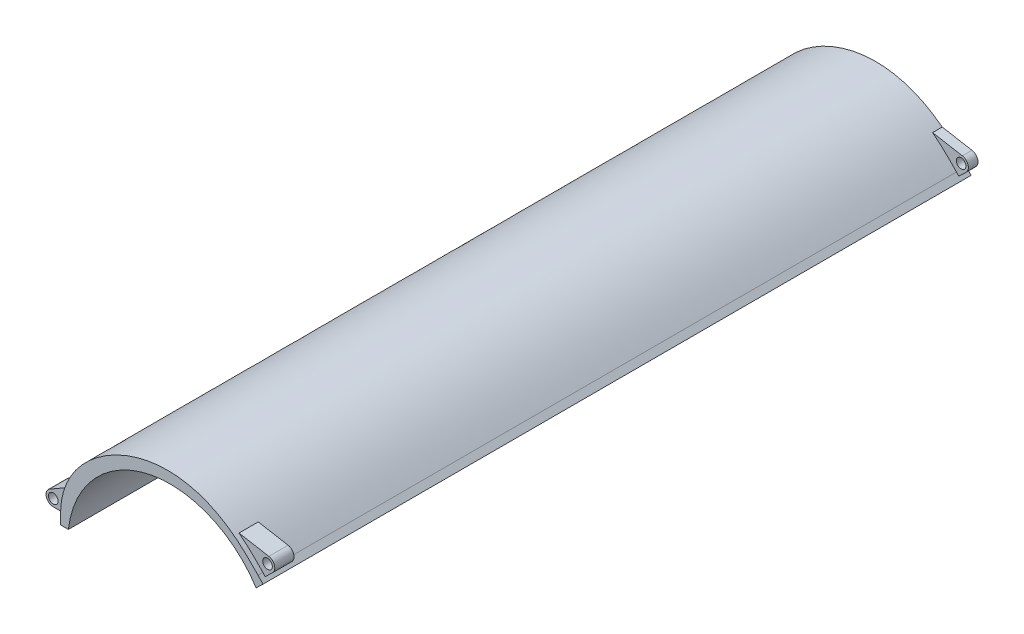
ISO-10303-21;
HEADER;
FILE_DESCRIPTION(('STEP AP214'),'2;1');
FILE_NAME('part.step','',(''),(''),'','','');
FILE_SCHEMA(('AUTOMOTIVE_DESIGN { 1 0 10303 214 1 1 1 1 }'));
ENDSEC;
DATA;
#1=APPLICATION_CONTEXT('core data for automotive mechanical design processes');
#2=APPLICATION_PROTOCOL_DEFINITION('international standard','automotive_design',2000,#1);
#3=PRODUCT_CONTEXT('',#1,'mechanical');
#4=PRODUCT('Part','Part','',(#3));
#5=PRODUCT_RELATED_PRODUCT_CATEGORY('part','',(#4));
#6=PRODUCT_DEFINITION_FORMATION('','',#4);
#7=PRODUCT_DEFINITION_CONTEXT('part definition',#1,'design');
#8=PRODUCT_DEFINITION('design','',#6,#7);
#9=PRODUCT_DEFINITION_SHAPE('','',#8);
#10=(LENGTH_UNIT() NAMED_UNIT(*) SI_UNIT(.MILLI.,.METRE.));
#11=(NAMED_UNIT(*) PLANE_ANGLE_UNIT() SI_UNIT($,.RADIAN.));
#12=(NAMED_UNIT(*) SI_UNIT($,.STERADIAN.) SOLID_ANGLE_UNIT());
#13=UNCERTAINTY_MEASURE_WITH_UNIT(LENGTH_MEASURE(1.E-05),#10,'distance_accuracy_value','');
#14=(GEOMETRIC_REPRESENTATION_CONTEXT(3) GLOBAL_UNCERTAINTY_ASSIGNED_CONTEXT((#13)) GLOBAL_UNIT_ASSIGNED_CONTEXT((#10,
#11,#12)) REPRESENTATION_CONTEXT('',''));
#15=CARTESIAN_POINT('',(0.,0.,0.));
#16=DIRECTION('',(0.,0.,1.));
#17=DIRECTION('',(1.,0.,0.));
#18=AXIS2_PLACEMENT_3D('',#15,#16,#17);
#19=CARTESIAN_POINT('',(-69.7200278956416,139.572690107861,735.));
#20=CARTESIAN_POINT('',(-108.187547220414,179.583185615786,735.));
#21=CARTESIAN_POINT('',(-152.416815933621,225.58654086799,735.));
#22=CARTESIAN_POINT('',(-219.133886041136,251.435560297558,735.));
#23=CARTESIAN_POINT('',(-287.408844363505,253.328836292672,735.));
#24=CARTESIAN_POINT('',(-359.356081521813,236.563554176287,735.));
#25=CARTESIAN_POINT('',(-477.15378099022,170.567422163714,735.));
#26=CARTESIAN_POINT('',(-479.524287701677,50.,735.));
#27=B_SPLINE_CURVE_WITH_KNOTS('',7,(#19,#20,#21,#22,#23,#24,#25,#26),.UNSPECIFIED.,.F.,.F.,(8,
8),(0.,1.),.UNSPECIFIED.);
#28=DIRECTION('',(0.,0.,-1.));
#29=VECTOR('',#28,1.);
#30=SURFACE_OF_LINEAR_EXTRUSION('',#27,#29);
#31=CARTESIAN_POINT('',(-119.307330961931,185.688881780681,-715.));
#32=CARTESIAN_POINT('',(-111.333957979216,179.561593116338,-715.));
#33=CARTESIAN_POINT('',(-103.683856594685,173.1559041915,-715.));
#34=CARTESIAN_POINT('',(-96.3532676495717,166.535005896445,-715.));
#35=CARTESIAN_POINT('',(-89.3294022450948,159.772367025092,-715.));
#36=CARTESIAN_POINT('',(-82.5854794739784,152.954189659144,-715.));
#37=CARTESIAN_POINT('',(-76.0741492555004,146.181682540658,-715.));
#38=CARTESIAN_POINT('',(-69.7200278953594,139.572690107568,-715.));
#39=B_SPLINE_CURVE_WITH_KNOTS('',7,(#31,#32,#33,#34,#35,#36,#37,#38),.UNSPECIFIED.,.F.,.F.,(8,
8),(0.,1.),.UNSPECIFIED.);
#40=CARTESIAN_POINT('',(-119.307330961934,185.688881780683,-715.));
#41=VERTEX_POINT('',#40);
#42=CARTESIAN_POINT('',(-69.7200278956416,139.572690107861,-715.));
#43=VERTEX_POINT('',#42);
#44=EDGE_CURVE('E58',#41,#43,#39,.T.);
#45=ORIENTED_EDGE('',*,*,#44,.F.);
#46=CARTESIAN_POINT('',(-119.307330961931,185.688881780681,-715.));
#47=DIRECTION('',(0.,0.,-1.));
#48=VECTOR('',#47,1.);
#49=LINE('',#46,#48);
#50=CARTESIAN_POINT('',(-119.307330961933,185.688881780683,-735.));
#51=VERTEX_POINT('',#50);
#52=EDGE_CURVE('E217',#41,#51,#49,.T.);
#53=ORIENTED_EDGE('',*,*,#52,.T.);
#54=CARTESIAN_POINT('',(-69.7200278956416,139.572690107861,-735.));
#55=CARTESIAN_POINT('',(-108.187547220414,179.583185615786,-735.));
#56=CARTESIAN_POINT('',(-152.416815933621,225.58654086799,-735.));
#57=CARTESIAN_POINT('',(-219.133886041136,251.435560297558,-735.));
#58=CARTESIAN_POINT('',(-287.408844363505,253.328836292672,-735.));
#59=CARTESIAN_POINT('',(-359.356081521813,236.563554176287,-735.));
#60=CARTESIAN_POINT('',(-477.15378099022,170.567422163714,-735.));
#61=CARTESIAN_POINT('',(-479.524287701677,50.,-735.));
#62=B_SPLINE_CURVE_WITH_KNOTS('',7,(#54,#55,#56,#57,#58,#59,#60,#61),.UNSPECIFIED.,.F.,.F.,(8,
8),(0.,1.),.UNSPECIFIED.);
#63=CARTESIAN_POINT('',(-472.826933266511,90.8956367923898,-735.));
#64=VERTEX_POINT('',#63);
#65=EDGE_CURVE('E370',#51,#64,#62,.T.);
#66=ORIENTED_EDGE('',*,*,#65,.T.);
#67=DIRECTION('',(0.,0.,-1.));
#68=VECTOR('',#67,1.);
#69=CARTESIAN_POINT('',(-472.826933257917,90.8956368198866,-715.));
#70=LINE('',#69,#68);
#71=CARTESIAN_POINT('',(-472.82693326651,90.8956367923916,-715.));
#72=VERTEX_POINT('',#71);
#73=EDGE_CURVE('E397',#72,#64,#70,.T.);
#74=ORIENTED_EDGE('',*,*,#73,.F.);
#75=CARTESIAN_POINT('',(-479.524287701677,50.0000000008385,-715.));
#76=CARTESIAN_POINT('',(-479.40077470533,56.2820507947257,-715.));
#77=CARTESIAN_POINT('',(-478.963896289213,62.4159497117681,-715.));
#78=CARTESIAN_POINT('',(-478.236465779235,68.4024521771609,-715.));
#79=CARTESIAN_POINT('',(-477.239796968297,74.2424995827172,-715.));
#80=CARTESIAN_POINT('',(-475.993797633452,79.9371958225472,-715.));
#81=CARTESIAN_POINT('',(-474.517057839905,85.4877859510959,-715.));
#82=CARTESIAN_POINT('',(-472.826933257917,90.8956368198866,-715.));
#83=B_SPLINE_CURVE_WITH_KNOTS('',7,(#75,#76,#77,#78,#79,#80,#81,#82),.UNSPECIFIED.,.F.,.F.,(8,
8),(0.,1.),.UNSPECIFIED.);
#84=CARTESIAN_POINT('',(-479.524287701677,50.,-715.));
#85=VERTEX_POINT('',#84);
#86=EDGE_CURVE('E411',#85,#72,#83,.T.);
#87=ORIENTED_EDGE('',*,*,#86,.F.);
#88=DIRECTION('',(0.,0.,-1.));
#89=VECTOR('',#88,1.);
#90=CARTESIAN_POINT('',(-479.524287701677,50.,735.));
#91=LINE('',#90,#89);
#92=CARTESIAN_POINT('',(-479.524287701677,50.0000000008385,685.));
#93=VERTEX_POINT('',#92);
#94=EDGE_CURVE('E393',#93,#85,#91,.T.);
#95=ORIENTED_EDGE('',*,*,#94,.F.);
#96=CARTESIAN_POINT('',(-479.524287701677,50.0000000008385,685.));
#97=CARTESIAN_POINT('',(-479.40077470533,56.2820507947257,685.));
#98=CARTESIAN_POINT('',(-478.963896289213,62.4159497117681,685.));
#99=CARTESIAN_POINT('',(-478.236465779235,68.4024521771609,685.));
#100=CARTESIAN_POINT('',(-477.239796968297,74.2424995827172,685.));
#101=CARTESIAN_POINT('',(-475.993797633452,79.9371958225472,685.));
#102=CARTESIAN_POINT('',(-474.517057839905,85.4877859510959,685.));
#103=CARTESIAN_POINT('',(-472.826933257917,90.8956368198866,685.));
#104=B_SPLINE_CURVE_WITH_KNOTS('',7,(#96,#97,#98,#99,#100,#101,#102,#103),.UNSPECIFIED.,.F.,.F.,
(8,8),(0.94789595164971,1.),.UNSPECIFIED.);
#105=CARTESIAN_POINT('',(-472.826933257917,90.8956368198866,685.));
#106=VERTEX_POINT('',#105);
#107=EDGE_CURVE('E513',#93,#106,#104,.T.);
#108=ORIENTED_EDGE('',*,*,#107,.T.);
#109=DIRECTION('',(0.,0.,1.));
#110=VECTOR('',#109,1.);
#111=CARTESIAN_POINT('',(-472.826933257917,90.8956368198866,685.));
#112=LINE('',#111,#110);
#113=CARTESIAN_POINT('',(-472.826933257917,90.8956368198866,725.));
#114=VERTEX_POINT('',#113);
#115=EDGE_CURVE('E541',#106,#114,#112,.T.);
#116=ORIENTED_EDGE('',*,*,#115,.T.);
#117=CARTESIAN_POINT('',(-479.524287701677,50.0000000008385,725.));
#118=CARTESIAN_POINT('',(-479.40077470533,56.2820507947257,725.));
#119=CARTESIAN_POINT('',(-478.963896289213,62.4159497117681,725.));
#120=CARTESIAN_POINT('',(-478.236465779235,68.4024521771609,725.));
#121=CARTESIAN_POINT('',(-477.239796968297,74.2424995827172,725.));
#122=CARTESIAN_POINT('',(-475.993797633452,79.9371958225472,725.));
#123=CARTESIAN_POINT('',(-474.517057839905,85.4877859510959,725.));
#124=CARTESIAN_POINT('',(-472.826933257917,90.8956368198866,725.));
#125=B_SPLINE_CURVE_WITH_KNOTS('',7,(#117,#118,#119,#120,#121,#122,#123,#124),.UNSPECIFIED.,.F.,
.F.,(8,8),(0.94789595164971,1.),.UNSPECIFIED.);
#126=CARTESIAN_POINT('',(-479.524287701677,50.0000000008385,725.));
#127=VERTEX_POINT('',#126);
#128=EDGE_CURVE('E531',#127,#114,#125,.T.);
#129=ORIENTED_EDGE('',*,*,#128,.F.);
#130=CARTESIAN_POINT('',(-479.524287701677,50.,735.));
#131=VERTEX_POINT('',#130);
#132=EDGE_CURVE('E387',#131,#127,#91,.T.);
#133=ORIENTED_EDGE('',*,*,#132,.F.);
#134=CARTESIAN_POINT('',(-69.7200278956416,139.572690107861,735.));
#135=VERTEX_POINT('',#134);
#136=EDGE_CURVE('E348',#135,#131,#27,.T.);
#137=ORIENTED_EDGE('',*,*,#136,.F.);
#138=DIRECTION('',(0.,0.,-1.));
#139=VECTOR('',#138,1.);
#140=CARTESIAN_POINT('',(-69.7200278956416,139.572690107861,735.));
#141=LINE('',#140,#139);
#142=CARTESIAN_POINT('',(-69.7200278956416,139.572690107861,725.));
#143=VERTEX_POINT('',#142);
#144=EDGE_CURVE('E11',#135,#143,#141,.T.);
#145=ORIENTED_EDGE('',*,*,#144,.T.);
#146=CARTESIAN_POINT('',(-119.307330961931,185.688881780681,725.));
#147=CARTESIAN_POINT('',(-111.333957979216,179.561593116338,725.));
#148=CARTESIAN_POINT('',(-103.683856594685,173.1559041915,725.));
#149=CARTESIAN_POINT('',(-96.3532676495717,166.535005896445,725.));
#150=CARTESIAN_POINT('',(-89.3294022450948,159.772367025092,725.));
#151=CARTESIAN_POINT('',(-82.5854794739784,152.954189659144,725.));
#152=CARTESIAN_POINT('',(-76.0741492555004,146.181682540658,725.));
#153=CARTESIAN_POINT('',(-69.7200278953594,139.572690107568,725.));
#154=B_SPLINE_CURVE_WITH_KNOTS('',7,(#146,#147,#148,#149,#150,#151,#152,#153),.UNSPECIFIED.,.F.,
.F.,(8,8),(0.,0.165181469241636),.UNSPECIFIED.);
#155=CARTESIAN_POINT('',(-119.307330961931,185.688881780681,725.));
#156=VERTEX_POINT('',#155);
#157=EDGE_CURVE('E466',#156,#143,#154,.T.);
#158=ORIENTED_EDGE('',*,*,#157,.F.);
#159=DIRECTION('',(0.,0.,1.));
#160=VECTOR('',#159,1.);
#161=CARTESIAN_POINT('',(-119.307330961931,185.688881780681,685.));
#162=LINE('',#161,#160);
#163=CARTESIAN_POINT('',(-119.307330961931,185.688881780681,685.));
#164=VERTEX_POINT('',#163);
#165=EDGE_CURVE('E400',#164,#156,#162,.T.);
#166=ORIENTED_EDGE('',*,*,#165,.F.);
#167=CARTESIAN_POINT('',(-119.307330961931,185.688881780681,685.));
#168=CARTESIAN_POINT('',(-111.333957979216,179.561593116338,685.));
#169=CARTESIAN_POINT('',(-103.683856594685,173.1559041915,685.));
#170=CARTESIAN_POINT('',(-96.3532676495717,166.535005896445,685.));
#171=CARTESIAN_POINT('',(-89.3294022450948,159.772367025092,685.));
#172=CARTESIAN_POINT('',(-82.5854794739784,152.954189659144,685.));
#173=CARTESIAN_POINT('',(-76.0741492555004,146.181682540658,685.));
#174=CARTESIAN_POINT('',(-69.7200278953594,139.572690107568,685.));
#175=B_SPLINE_CURVE_WITH_KNOTS('',7,(#167,#168,#169,#170,#171,#172,#173,#174),.UNSPECIFIED.,.F.,
.F.,(8,8),(0.,0.165181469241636),.UNSPECIFIED.);
#176=CARTESIAN_POINT('',(-69.7200278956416,139.572690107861,685.));
#177=VERTEX_POINT('',#176);
#178=EDGE_CURVE('E457',#164,#177,#175,.T.);
#179=ORIENTED_EDGE('',*,*,#178,.T.);
#180=EDGE_CURVE('E50',#177,#43,#141,.T.);
#181=ORIENTED_EDGE('',*,*,#180,.T.);
#182=EDGE_LOOP('',(#45,#53,#66,#74,#87,#95,#108,#116,#129,#133,#137,#145,#158,#166,#179,#181));
#183=FACE_BOUND('',#182,.T.);
#184=ADVANCED_FACE('F41',(#183),#30,.F.);
#185=CARTESIAN_POINT('',(-479.524287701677,25.,735.));
#186=DIRECTION('',(1.,0.,0.));
#187=DIRECTION('',(0.,1.,0.));
#188=AXIS2_PLACEMENT_3D('',#185,#186,#187);
#189=PLANE('',#188);
#190=DIRECTION('',(0.,-1.,0.));
#191=VECTOR('',#190,1.);
#192=CARTESIAN_POINT('',(-479.524287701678,234.472912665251,-715.));
#193=LINE('',#192,#191);
#194=CARTESIAN_POINT('',(-479.524287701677,40.,-715.));
#195=VERTEX_POINT('',#194);
#196=EDGE_CURVE('E419',#85,#195,#193,.T.);
#197=ORIENTED_EDGE('',*,*,#196,.T.);
#198=DIRECTION('',(0.,0.,-1.));
#199=VECTOR('',#198,1.);
#200=CARTESIAN_POINT('',(-479.524287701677,40.,-715.));
#201=LINE('',#200,#199);
#202=CARTESIAN_POINT('',(-479.524287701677,40.,-735.));
#203=VERTEX_POINT('',#202);
#204=EDGE_CURVE('E423',#195,#203,#201,.T.);
#205=ORIENTED_EDGE('',*,*,#204,.T.);
#206=DIRECTION('',(0.,-1.,0.));
#207=VECTOR('',#206,1.);
#208=CARTESIAN_POINT('',(-479.524287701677,25.,-735.));
#209=LINE('',#208,#207);
#210=CARTESIAN_POINT('',(-479.524287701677,25.,-735.));
#211=VERTEX_POINT('',#210);
#212=EDGE_CURVE('E376',#203,#211,#209,.T.);
#213=ORIENTED_EDGE('',*,*,#212,.T.);
#214=DIRECTION('',(0.,0.,-1.));
#215=VECTOR('',#214,1.);
#216=CARTESIAN_POINT('',(-479.524287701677,25.,735.));
#217=LINE('',#216,#215);
#218=CARTESIAN_POINT('',(-479.524287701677,25.,735.));
#219=VERTEX_POINT('',#218);
#220=EDGE_CURVE('E396',#219,#211,#217,.T.);
#221=ORIENTED_EDGE('',*,*,#220,.F.);
#222=DIRECTION('',(0.,-1.,0.));
#223=VECTOR('',#222,1.);
#224=CARTESIAN_POINT('',(-479.524287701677,25.,735.));
#225=LINE('',#224,#223);
#226=EDGE_CURVE('E354',#131,#219,#225,.T.);
#227=ORIENTED_EDGE('',*,*,#226,.F.);
#228=ORIENTED_EDGE('',*,*,#132,.T.);
#229=DIRECTION('',(0.,1.,0.));
#230=VECTOR('',#229,1.);
#231=CARTESIAN_POINT('',(-479.524287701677,50.0000000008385,725.));
#232=LINE('',#231,#230);
#233=CARTESIAN_POINT('',(-479.524287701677,40.,725.));
#234=VERTEX_POINT('',#233);
#235=EDGE_CURVE('E529',#234,#127,#232,.T.);
#236=ORIENTED_EDGE('',*,*,#235,.F.);
#237=DIRECTION('',(0.,0.,1.));
#238=VECTOR('',#237,1.);
#239=CARTESIAN_POINT('',(-479.524287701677,40.,685.));
#240=LINE('',#239,#238);
#241=CARTESIAN_POINT('',(-479.524287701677,40.,685.));
#242=VERTEX_POINT('',#241);
#243=EDGE_CURVE('E544',#242,#234,#240,.T.);
#244=ORIENTED_EDGE('',*,*,#243,.F.);
#245=DIRECTION('',(0.,1.,0.));
#246=VECTOR('',#245,1.);
#247=CARTESIAN_POINT('',(-479.524287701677,50.0000000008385,685.));
#248=LINE('',#247,#246);
#249=EDGE_CURVE('E510',#242,#93,#248,.T.);
#250=ORIENTED_EDGE('',*,*,#249,.T.);
#251=ORIENTED_EDGE('',*,*,#94,.T.);
#252=EDGE_LOOP('',(#197,#205,#213,#221,#227,#228,#236,#244,#250,#251));
#253=FACE_BOUND('',#252,.T.);
#254=ADVANCED_FACE('F341',(#253),#189,.F.);
#255=CARTESIAN_POINT('',(-59.3239744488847,128.759639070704,735.));
#256=DIRECTION('',(-0.720870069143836,-0.693070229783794,0.));
#257=DIRECTION('',(0.693070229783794,-0.720870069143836,0.));
#258=AXIS2_PLACEMENT_3D('',#255,#256,#257);
#259=PLANE('',#258);
#260=DIRECTION('',(-0.693070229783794,0.720870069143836,0.));
#261=VECTOR('',#260,1.);
#262=CARTESIAN_POINT('',(-59.3239744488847,128.759639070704,-735.));
#263=LINE('',#262,#261);
#264=CARTESIAN_POINT('',(-59.3239744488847,128.759639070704,-735.));
#265=VERTEX_POINT('',#264);
#266=CARTESIAN_POINT('',(-64.8607561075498,134.51850737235,-735.));
#267=VERTEX_POINT('',#266);
#268=EDGE_CURVE('E368',#265,#267,#263,.T.);
#269=ORIENTED_EDGE('',*,*,#268,.T.);
#270=DIRECTION('',(0.,0.,-1.));
#271=VECTOR('',#270,1.);
#272=CARTESIAN_POINT('',(-64.8607561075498,134.51850737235,-715.));
#273=LINE('',#272,#271);
#274=CARTESIAN_POINT('',(-64.8607561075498,134.51850737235,-715.));
#275=VERTEX_POINT('',#274);
#276=EDGE_CURVE('E66',#275,#267,#273,.T.);
#277=ORIENTED_EDGE('',*,*,#276,.F.);
#278=DIRECTION('',(-0.693070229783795,0.720870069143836,0.));
#279=VECTOR('',#278,1.);
#280=CARTESIAN_POINT('',(-207.944056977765,283.341043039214,-715.));
#281=LINE('',#280,#279);
#282=EDGE_CURVE('E229',#275,#43,#281,.T.);
#283=ORIENTED_EDGE('',*,*,#282,.T.);
#284=ORIENTED_EDGE('',*,*,#180,.F.);
#285=DIRECTION('',(0.693070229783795,-0.720870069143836,0.));
#286=VECTOR('',#285,1.);
#287=CARTESIAN_POINT('',(-64.8607561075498,134.51850737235,685.));
#288=LINE('',#287,#286);
#289=CARTESIAN_POINT('',(-64.8607561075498,134.51850737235,685.));
#290=VERTEX_POINT('',#289);
#291=EDGE_CURVE('E483',#177,#290,#288,.T.);
#292=ORIENTED_EDGE('',*,*,#291,.T.);
#293=DIRECTION('',(0.,0.,1.));
#294=VECTOR('',#293,1.);
#295=CARTESIAN_POINT('',(-64.8607561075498,134.51850737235,685.));
#296=LINE('',#295,#294);
#297=CARTESIAN_POINT('',(-64.8607561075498,134.51850737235,725.));
#298=VERTEX_POINT('',#297);
#299=EDGE_CURVE('E444',#290,#298,#296,.T.);
#300=ORIENTED_EDGE('',*,*,#299,.T.);
#301=DIRECTION('',(0.693070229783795,-0.720870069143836,0.));
#302=VECTOR('',#301,1.);
#303=CARTESIAN_POINT('',(-64.8607561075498,134.51850737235,725.));
#304=LINE('',#303,#302);
#305=EDGE_CURVE('E463',#143,#298,#304,.T.);
#306=ORIENTED_EDGE('',*,*,#305,.F.);
#307=ORIENTED_EDGE('',*,*,#144,.F.);
#308=DIRECTION('',(-0.693070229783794,0.720870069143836,0.));
#309=VECTOR('',#308,1.);
#310=CARTESIAN_POINT('',(-59.3239744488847,128.759639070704,735.));
#311=LINE('',#310,#309);
#312=CARTESIAN_POINT('',(-59.3239744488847,128.759639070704,735.));
#313=VERTEX_POINT('',#312);
#314=EDGE_CURVE('E355',#313,#135,#311,.T.);
#315=ORIENTED_EDGE('',*,*,#314,.F.);
#316=DIRECTION('',(0.,0.,-1.));
#317=VECTOR('',#316,1.);
#318=CARTESIAN_POINT('',(-59.3239744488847,128.759639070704,735.));
#319=LINE('',#318,#317);
#320=EDGE_CURVE('E367',#313,#265,#319,.T.);
#321=ORIENTED_EDGE('',*,*,#320,.T.);
#322=EDGE_LOOP('',(#269,#277,#283,#284,#292,#300,#306,#307,#315,#321));
#323=FACE_BOUND('',#322,.T.);
#324=ADVANCED_FACE('F43',(#323),#259,.F.);
#325=CARTESIAN_POINT('',(-463.524287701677,25.,735.));
#326=DIRECTION('',(0.,1.,0.));
#327=DIRECTION('',(0.,0.,1.));
#328=AXIS2_PLACEMENT_3D('',#325,#326,#327);
#329=PLANE('',#328);
#330=DIRECTION('',(1.,0.,0.));
#331=VECTOR('',#330,1.);
#332=CARTESIAN_POINT('',(-463.524287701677,25.,-735.));
#333=LINE('',#332,#331);
#334=CARTESIAN_POINT('',(-463.524287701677,25.0000000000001,-735.));
#335=VERTEX_POINT('',#334);
#336=EDGE_CURVE('E615',#211,#335,#333,.T.);
#337=ORIENTED_EDGE('',*,*,#336,.T.);
#338=DIRECTION('',(0.,0.,-1.));
#339=VECTOR('',#338,1.);
#340=CARTESIAN_POINT('',(-463.524287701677,25.0000000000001,735.));
#341=LINE('',#340,#339);
#342=CARTESIAN_POINT('',(-463.524287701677,25.0000000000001,735.));
#343=VERTEX_POINT('',#342);
#344=EDGE_CURVE('E627',#343,#335,#341,.T.);
#345=ORIENTED_EDGE('',*,*,#344,.F.);
#346=DIRECTION('',(1.,0.,0.));
#347=VECTOR('',#346,1.);
#348=CARTESIAN_POINT('',(-463.524287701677,25.,735.));
#349=LINE('',#348,#347);
#350=EDGE_CURVE('E361',#219,#343,#349,.T.);
#351=ORIENTED_EDGE('',*,*,#350,.F.);
#352=ORIENTED_EDGE('',*,*,#220,.T.);
#353=EDGE_LOOP('',(#337,#345,#351,#352));
#354=FACE_BOUND('',#353,.T.);
#355=ADVANCED_FACE('F336',(#354),#329,.F.);
#356=CARTESIAN_POINT('',(-252.5,1.52655665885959E-13,735.));
#357=DIRECTION('',(0.,0.,-1.));
#358=DIRECTION('',(-1.,0.,0.));
#359=AXIS2_PLACEMENT_3D('',#356,#357,#358);
#360=CYLINDRICAL_SURFACE('',#359,212.5);
#361=CARTESIAN_POINT('',(-252.5,1.52655665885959E-13,-735.));
#362=DIRECTION('',(0.,0.,-1.));
#363=DIRECTION('',(1.,0.,0.));
#364=AXIS2_PLACEMENT_3D('',#361,#362,#363);
#365=CIRCLE('',#364,212.5);
#366=CARTESIAN_POINT('',(-73.7413758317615,114.898234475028,-735.));
#367=VERTEX_POINT('',#366);
#368=EDGE_CURVE('E617',#335,#367,#365,.T.);
#369=ORIENTED_EDGE('',*,*,#368,.T.);
#370=DIRECTION('',(0.,0.,-1.));
#371=VECTOR('',#370,1.);
#372=CARTESIAN_POINT('',(-73.7413758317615,114.898234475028,735.));
#373=LINE('',#372,#371);
#374=CARTESIAN_POINT('',(-73.7413758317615,114.898234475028,735.));
#375=VERTEX_POINT('',#374);
#376=EDGE_CURVE('E624',#375,#367,#373,.T.);
#377=ORIENTED_EDGE('',*,*,#376,.F.);
#378=CARTESIAN_POINT('',(-252.5,1.52655665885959E-13,735.));
#379=DIRECTION('',(0.,0.,-1.));
#380=DIRECTION('',(1.,0.,0.));
#381=AXIS2_PLACEMENT_3D('',#378,#379,#380);
#382=CIRCLE('',#381,212.5);
#383=EDGE_CURVE('E363',#343,#375,#382,.T.);
#384=ORIENTED_EDGE('',*,*,#383,.F.);
#385=ORIENTED_EDGE('',*,*,#344,.T.);
#386=EDGE_LOOP('',(#369,#377,#384,#385));
#387=FACE_BOUND('',#386,.T.);
#388=ADVANCED_FACE('F332',(#387),#360,.F.);
#389=CARTESIAN_POINT('',(-59.3239744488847,128.759639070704,735.));
#390=DIRECTION('',(-0.693070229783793,0.720870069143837,0.));
#391=DIRECTION('',(-0.720870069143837,-0.693070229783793,0.));
#392=AXIS2_PLACEMENT_3D('',#389,#390,#391);
#393=PLANE('',#392);
#394=DIRECTION('',(0.720870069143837,0.693070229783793,0.));
#395=VECTOR('',#394,1.);
#396=CARTESIAN_POINT('',(-59.3239744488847,128.759639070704,-735.));
#397=LINE('',#396,#395);
#398=EDGE_CURVE('E568',#367,#265,#397,.T.);
#399=ORIENTED_EDGE('',*,*,#398,.T.);
#400=ORIENTED_EDGE('',*,*,#320,.F.);
#401=DIRECTION('',(0.720870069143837,0.693070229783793,0.));
#402=VECTOR('',#401,1.);
#403=CARTESIAN_POINT('',(-59.3239744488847,128.759639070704,735.));
#404=LINE('',#403,#402);
#405=EDGE_CURVE('E365',#375,#313,#404,.T.);
#406=ORIENTED_EDGE('',*,*,#405,.F.);
#407=ORIENTED_EDGE('',*,*,#376,.T.);
#408=EDGE_LOOP('',(#399,#400,#406,#407));
#409=FACE_BOUND('',#408,.T.);
#410=ADVANCED_FACE('F325',(#409),#393,.F.);
#411=CARTESIAN_POINT('',(-258.772343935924,234.472912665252,735.));
#412=DIRECTION('',(0.,0.,-1.));
#413=DIRECTION('',(-1.,0.,0.));
#414=AXIS2_PLACEMENT_3D('',#411,#412,#413);
#415=PLANE('',#414);
#416=ORIENTED_EDGE('',*,*,#314,.T.);
#417=ORIENTED_EDGE('',*,*,#136,.T.);
#418=ORIENTED_EDGE('',*,*,#226,.T.);
#419=ORIENTED_EDGE('',*,*,#350,.T.);
#420=ORIENTED_EDGE('',*,*,#383,.T.);
#421=ORIENTED_EDGE('',*,*,#405,.T.);
#422=EDGE_LOOP('',(#416,#417,#418,#419,#420,#421));
#423=FACE_BOUND('',#422,.T.);
#424=ADVANCED_FACE('F322',(#423),#415,.F.);
#425=CARTESIAN_POINT('',(-258.772343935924,234.472912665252,-735.));
#426=DIRECTION('',(0.,0.,-1.));
#427=DIRECTION('',(-1.,0.,0.));
#428=AXIS2_PLACEMENT_3D('',#425,#426,#427);
#429=PLANE('',#428);
#430=ORIENTED_EDGE('',*,*,#65,.F.);
#431=DIRECTION('',(0.984807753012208,-0.173648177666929,0.));
#432=VECTOR('',#431,1.);
#433=CARTESIAN_POINT('',(-262.909519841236,211.009822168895,-735.));
#434=LINE('',#433,#432);
#435=CARTESIAN_POINT('',(-57.3952773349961,174.772116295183,-735.));
#436=VERTEX_POINT('',#435);
#437=EDGE_CURVE('E241',#51,#436,#434,.T.);
#438=ORIENTED_EDGE('',*,*,#437,.T.);
#439=CARTESIAN_POINT('',(-60.0000000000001,160.,-735.));
#440=DIRECTION('',(0.,0.,-1.));
#441=DIRECTION('',(-1.,0.,0.));
#442=AXIS2_PLACEMENT_3D('',#439,#440,#441);
#443=CIRCLE('',#442,15.);
#444=CARTESIAN_POINT('',(-49.6039465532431,149.186948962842,-735.));
#445=VERTEX_POINT('',#444);
#446=EDGE_CURVE('E211',#436,#445,#443,.T.);
#447=ORIENTED_EDGE('',*,*,#446,.T.);
#448=DIRECTION('',(-0.720870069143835,-0.693070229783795,0.));
#449=VECTOR('',#448,1.);
#450=CARTESIAN_POINT('',(-115.689043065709,85.6503769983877,-735.));
#451=LINE('',#450,#449);
#452=EDGE_CURVE('E580',#445,#267,#451,.T.);
#453=ORIENTED_EDGE('',*,*,#452,.T.);
#454=ORIENTED_EDGE('',*,*,#268,.F.);
#455=ORIENTED_EDGE('',*,*,#398,.F.);
#456=ORIENTED_EDGE('',*,*,#368,.F.);
#457=ORIENTED_EDGE('',*,*,#336,.F.);
#458=ORIENTED_EDGE('',*,*,#212,.F.);
#459=DIRECTION('',(-1.,0.,0.));
#460=VECTOR('',#459,1.);
#461=CARTESIAN_POINT('',(-258.772343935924,40.,-735.));
#462=LINE('',#461,#460);
#463=CARTESIAN_POINT('',(-505.,40.,-735.));
#464=VERTEX_POINT('',#463);
#465=EDGE_CURVE('E415',#203,#464,#462,.T.);
#466=ORIENTED_EDGE('',*,*,#465,.T.);
#467=CARTESIAN_POINT('',(-505.,55.,-735.));
#468=DIRECTION('',(0.,0.,-1.));
#469=DIRECTION('',(-1.,0.,0.));
#470=AXIS2_PLACEMENT_3D('',#467,#468,#469);
#471=CIRCLE('',#470,15.);
#472=CARTESIAN_POINT('',(-512.5,67.9903810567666,-735.));
#473=VERTEX_POINT('',#472);
#474=EDGE_CURVE('E407',#464,#473,#471,.T.);
#475=ORIENTED_EDGE('',*,*,#474,.T.);
#476=DIRECTION('',(0.866025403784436,0.500000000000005,0.));
#477=VECTOR('',#476,1.);
#478=CARTESIAN_POINT('',(-250.115207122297,219.478311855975,-735.));
#479=LINE('',#478,#477);
#480=EDGE_CURVE('E404',#473,#64,#479,.T.);
#481=ORIENTED_EDGE('',*,*,#480,.T.);
#482=EDGE_LOOP('',(#430,#438,#447,#453,#454,#455,#456,#457,#458,#466,#475,#481));
#483=FACE_BOUND('',#482,.T.);
#484=CARTESIAN_POINT('',(-505.,55.,-735.));
#485=DIRECTION('',(0.,0.,-1.));
#486=DIRECTION('',(-1.,0.,0.));
#487=AXIS2_PLACEMENT_3D('',#484,#485,#486);
#488=CIRCLE('',#487,9.99999999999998);
#489=CARTESIAN_POINT('',(-515.,55.,-735.));
#490=VERTEX_POINT('',#489);
#491=EDGE_CURVE('E599',#490,#490,#488,.T.);
#492=ORIENTED_EDGE('',*,*,#491,.F.);
#493=EDGE_LOOP('',(#492));
#494=FACE_BOUND('',#493,.T.);
#495=CARTESIAN_POINT('',(-60.0000000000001,160.,-735.));
#496=DIRECTION('',(0.,0.,-1.));
#497=DIRECTION('',(-1.,0.,0.));
#498=AXIS2_PLACEMENT_3D('',#495,#496,#497);
#499=CIRCLE('',#498,9.99999999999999);
#500=CARTESIAN_POINT('',(-70.,160.,-735.));
#501=VERTEX_POINT('',#500);
#502=EDGE_CURVE('E634',#501,#501,#499,.T.);
#503=ORIENTED_EDGE('',*,*,#502,.F.);
#504=EDGE_LOOP('',(#503));
#505=FACE_BOUND('',#504,.T.);
#506=ADVANCED_FACE('F320',(#483,#494,#505),#429,.T.);
#507=CARTESIAN_POINT('',(-505.,55.,685.));
#508=DIRECTION('',(0.,0.,1.));
#509=DIRECTION('',(1.,0.,0.));
#510=AXIS2_PLACEMENT_3D('',#507,#508,#509);
#511=CYLINDRICAL_SURFACE('',#510,15.);
#512=CARTESIAN_POINT('',(-505.,55.,725.));
#513=DIRECTION('',(0.,0.,1.));
#514=DIRECTION('',(1.,0.,0.));
#515=AXIS2_PLACEMENT_3D('',#512,#513,#514);
#516=CIRCLE('',#515,15.);
#517=CARTESIAN_POINT('',(-512.5,67.9903810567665,725.));
#518=VERTEX_POINT('',#517);
#519=CARTESIAN_POINT('',(-505.,40.,725.));
#520=VERTEX_POINT('',#519);
#521=EDGE_CURVE('E500',#518,#520,#516,.T.);
#522=ORIENTED_EDGE('',*,*,#521,.F.);
#523=DIRECTION('',(0.,0.,1.));
#524=VECTOR('',#523,1.);
#525=CARTESIAN_POINT('',(-512.5,67.9903810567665,685.));
#526=LINE('',#525,#524);
#527=CARTESIAN_POINT('',(-512.5,67.9903810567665,685.));
#528=VERTEX_POINT('',#527);
#529=EDGE_CURVE('E371',#528,#518,#526,.T.);
#530=ORIENTED_EDGE('',*,*,#529,.F.);
#531=CARTESIAN_POINT('',(-505.,55.,685.));
#532=DIRECTION('',(0.,0.,1.));
#533=DIRECTION('',(1.,0.,0.));
#534=AXIS2_PLACEMENT_3D('',#531,#532,#533);
#535=CIRCLE('',#534,15.);
#536=CARTESIAN_POINT('',(-505.,40.,685.));
#537=VERTEX_POINT('',#536);
#538=EDGE_CURVE('E503',#528,#537,#535,.T.);
#539=ORIENTED_EDGE('',*,*,#538,.T.);
#540=DIRECTION('',(0.,0.,1.));
#541=VECTOR('',#540,1.);
#542=CARTESIAN_POINT('',(-505.,40.,685.));
#543=LINE('',#542,#541);
#544=EDGE_CURVE('E524',#537,#520,#543,.T.);
#545=ORIENTED_EDGE('',*,*,#544,.T.);
#546=EDGE_LOOP('',(#522,#530,#539,#545));
#547=FACE_BOUND('',#546,.T.);
#548=ADVANCED_FACE('F313',(#547),#511,.T.);
#549=CARTESIAN_POINT('',(-512.5,67.9903810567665,685.));
#550=DIRECTION('',(-0.500000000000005,0.866025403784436,0.));
#551=DIRECTION('',(-0.866025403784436,-0.500000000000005,0.));
#552=AXIS2_PLACEMENT_3D('',#549,#550,#551);
#553=PLANE('',#552);
#554=DIRECTION('',(-0.866025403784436,-0.500000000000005,0.));
#555=VECTOR('',#554,1.);
#556=CARTESIAN_POINT('',(-512.5,67.9903810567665,725.));
#557=LINE('',#556,#555);
#558=EDGE_CURVE('E507',#114,#518,#557,.T.);
#559=ORIENTED_EDGE('',*,*,#558,.F.);
#560=ORIENTED_EDGE('',*,*,#115,.F.);
#561=DIRECTION('',(-0.866025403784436,-0.500000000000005,0.));
#562=VECTOR('',#561,1.);
#563=CARTESIAN_POINT('',(-512.5,67.9903810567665,685.));
#564=LINE('',#563,#562);
#565=EDGE_CURVE('E518',#106,#528,#564,.T.);
#566=ORIENTED_EDGE('',*,*,#565,.T.);
#567=ORIENTED_EDGE('',*,*,#529,.T.);
#568=EDGE_LOOP('',(#559,#560,#566,#567));
#569=FACE_BOUND('',#568,.T.);
#570=ADVANCED_FACE('F310',(#569),#553,.T.);
#571=CARTESIAN_POINT('',(-505.,40.,685.));
#572=DIRECTION('',(0.,-1.,0.));
#573=DIRECTION('',(0.,0.,-1.));
#574=AXIS2_PLACEMENT_3D('',#571,#572,#573);
#575=PLANE('',#574);
#576=DIRECTION('',(1.,0.,0.));
#577=VECTOR('',#576,1.);
#578=CARTESIAN_POINT('',(-505.,40.,725.));
#579=LINE('',#578,#577);
#580=EDGE_CURVE('E527',#520,#234,#579,.T.);
#581=ORIENTED_EDGE('',*,*,#580,.F.);
#582=ORIENTED_EDGE('',*,*,#544,.F.);
#583=DIRECTION('',(1.,0.,0.));
#584=VECTOR('',#583,1.);
#585=CARTESIAN_POINT('',(-505.,40.,685.));
#586=LINE('',#585,#584);
#587=EDGE_CURVE('E506',#537,#242,#586,.T.);
#588=ORIENTED_EDGE('',*,*,#587,.T.);
#589=ORIENTED_EDGE('',*,*,#243,.T.);
#590=EDGE_LOOP('',(#581,#582,#588,#589));
#591=FACE_BOUND('',#590,.T.);
#592=ADVANCED_FACE('F305',(#591),#575,.T.);
#593=CARTESIAN_POINT('',(-505.,55.,685.));
#594=DIRECTION('',(0.,0.,1.));
#595=DIRECTION('',(1.,0.,0.));
#596=AXIS2_PLACEMENT_3D('',#593,#594,#595);
#597=PLANE('',#596);
#598=CARTESIAN_POINT('',(-505.,55.,685.));
#599=DIRECTION('',(0.,0.,1.));
#600=DIRECTION('',(1.,0.,0.));
#601=AXIS2_PLACEMENT_3D('',#598,#599,#600);
#602=CIRCLE('',#601,9.99999999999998);
#603=CARTESIAN_POINT('',(-495.,55.,685.));
#604=VERTEX_POINT('',#603);
#605=EDGE_CURVE('E497',#604,#604,#602,.T.);
#606=ORIENTED_EDGE('',*,*,#605,.T.);
#607=EDGE_LOOP('',(#606));
#608=FACE_BOUND('',#607,.T.);
#609=ORIENTED_EDGE('',*,*,#538,.F.);
#610=ORIENTED_EDGE('',*,*,#565,.F.);
#611=ORIENTED_EDGE('',*,*,#107,.F.);
#612=ORIENTED_EDGE('',*,*,#249,.F.);
#613=ORIENTED_EDGE('',*,*,#587,.F.);
#614=EDGE_LOOP('',(#609,#610,#611,#612,#613));
#615=FACE_BOUND('',#614,.T.);
#616=ADVANCED_FACE('F302',(#608,#615),#597,.F.);
#617=CARTESIAN_POINT('',(-505.,55.,725.));
#618=DIRECTION('',(0.,0.,1.));
#619=DIRECTION('',(1.,0.,0.));
#620=AXIS2_PLACEMENT_3D('',#617,#618,#619);
#621=PLANE('',#620);
#622=CARTESIAN_POINT('',(-505.,55.,725.));
#623=DIRECTION('',(0.,0.,1.));
#624=DIRECTION('',(1.,0.,0.));
#625=AXIS2_PLACEMENT_3D('',#622,#623,#624);
#626=CIRCLE('',#625,9.99999999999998);
#627=CARTESIAN_POINT('',(-495.,55.,725.));
#628=VERTEX_POINT('',#627);
#629=EDGE_CURVE('E494',#628,#628,#626,.T.);
#630=ORIENTED_EDGE('',*,*,#629,.F.);
#631=EDGE_LOOP('',(#630));
#632=FACE_BOUND('',#631,.T.);
#633=ORIENTED_EDGE('',*,*,#521,.T.);
#634=ORIENTED_EDGE('',*,*,#580,.T.);
#635=ORIENTED_EDGE('',*,*,#235,.T.);
#636=ORIENTED_EDGE('',*,*,#128,.T.);
#637=ORIENTED_EDGE('',*,*,#558,.T.);
#638=EDGE_LOOP('',(#633,#634,#635,#636,#637));
#639=FACE_BOUND('',#638,.T.);
#640=ADVANCED_FACE('F300',(#632,#639),#621,.T.);
#641=CARTESIAN_POINT('',(-505.,55.,685.));
#642=DIRECTION('',(0.,0.,1.));
#643=DIRECTION('',(1.,0.,0.));
#644=AXIS2_PLACEMENT_3D('',#641,#642,#643);
#645=CYLINDRICAL_SURFACE('',#644,9.99999999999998);
#646=ORIENTED_EDGE('',*,*,#605,.F.);
#647=EDGE_LOOP('',(#646));
#648=FACE_BOUND('',#647,.T.);
#649=ORIENTED_EDGE('',*,*,#629,.T.);
#650=EDGE_LOOP('',(#649));
#651=FACE_BOUND('',#650,.T.);
#652=ADVANCED_FACE('F286',(#648,#651),#645,.F.);
#653=CARTESIAN_POINT('',(-57.3952773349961,174.772116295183,685.));
#654=DIRECTION('',(0.173648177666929,0.984807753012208,0.));
#655=DIRECTION('',(-0.984807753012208,0.173648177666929,0.));
#656=AXIS2_PLACEMENT_3D('',#653,#654,#655);
#657=PLANE('',#656);
#658=DIRECTION('',(-0.984807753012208,0.173648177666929,0.));
#659=VECTOR('',#658,1.);
#660=CARTESIAN_POINT('',(-57.3952773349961,174.772116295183,725.));
#661=LINE('',#660,#659);
#662=CARTESIAN_POINT('',(-57.3952773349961,174.772116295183,725.));
#663=VERTEX_POINT('',#662);
#664=EDGE_CURVE('E453',#663,#156,#661,.T.);
#665=ORIENTED_EDGE('',*,*,#664,.F.);
#666=DIRECTION('',(0.,0.,1.));
#667=VECTOR('',#666,1.);
#668=CARTESIAN_POINT('',(-57.3952773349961,174.772116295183,685.));
#669=LINE('',#668,#667);
#670=CARTESIAN_POINT('',(-57.3952773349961,174.772116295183,685.));
#671=VERTEX_POINT('',#670);
#672=EDGE_CURVE('E449',#671,#663,#669,.T.);
#673=ORIENTED_EDGE('',*,*,#672,.F.);
#674=DIRECTION('',(-0.984807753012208,0.173648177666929,0.));
#675=VECTOR('',#674,1.);
#676=CARTESIAN_POINT('',(-57.3952773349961,174.772116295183,685.));
#677=LINE('',#676,#675);
#678=EDGE_CURVE('E446',#671,#164,#677,.T.);
#679=ORIENTED_EDGE('',*,*,#678,.T.);
#680=ORIENTED_EDGE('',*,*,#165,.T.);
#681=EDGE_LOOP('',(#665,#673,#679,#680));
#682=FACE_BOUND('',#681,.T.);
#683=ADVANCED_FACE('F282',(#682),#657,.T.);
#684=CARTESIAN_POINT('',(-60.0000000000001,160.,685.));
#685=DIRECTION('',(0.,0.,1.));
#686=DIRECTION('',(1.,0.,0.));
#687=AXIS2_PLACEMENT_3D('',#684,#685,#686);
#688=CYLINDRICAL_SURFACE('',#687,15.);
#689=CARTESIAN_POINT('',(-60.0000000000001,160.,725.));
#690=DIRECTION('',(0.,0.,1.));
#691=DIRECTION('',(1.,0.,0.));
#692=AXIS2_PLACEMENT_3D('',#689,#690,#691);
#693=CIRCLE('',#692,15.);
#694=CARTESIAN_POINT('',(-49.6039465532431,149.186948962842,725.));
#695=VERTEX_POINT('',#694);
#696=EDGE_CURVE('E456',#695,#663,#693,.T.);
#697=ORIENTED_EDGE('',*,*,#696,.F.);
#698=DIRECTION('',(0.,0.,1.));
#699=VECTOR('',#698,1.);
#700=CARTESIAN_POINT('',(-49.6039465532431,149.186948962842,685.));
#701=LINE('',#700,#699);
#702=CARTESIAN_POINT('',(-49.6039465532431,149.186948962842,685.));
#703=VERTEX_POINT('',#702);
#704=EDGE_CURVE('E447',#703,#695,#701,.T.);
#705=ORIENTED_EDGE('',*,*,#704,.F.);
#706=CARTESIAN_POINT('',(-60.0000000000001,160.,685.));
#707=DIRECTION('',(0.,0.,1.));
#708=DIRECTION('',(1.,0.,0.));
#709=AXIS2_PLACEMENT_3D('',#706,#707,#708);
#710=CIRCLE('',#709,15.);
#711=EDGE_CURVE('E477',#703,#671,#710,.T.);
#712=ORIENTED_EDGE('',*,*,#711,.T.);
#713=ORIENTED_EDGE('',*,*,#672,.T.);
#714=EDGE_LOOP('',(#697,#705,#712,#713));
#715=FACE_BOUND('',#714,.T.);
#716=ADVANCED_FACE('F278',(#715),#688,.T.);
#717=CARTESIAN_POINT('',(-49.6039465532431,149.186948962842,685.));
#718=DIRECTION('',(0.693070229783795,-0.720870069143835,0.));
#719=DIRECTION('',(0.720870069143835,0.693070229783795,0.));
#720=AXIS2_PLACEMENT_3D('',#717,#718,#719);
#721=PLANE('',#720);
#722=DIRECTION('',(0.720870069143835,0.693070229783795,0.));
#723=VECTOR('',#722,1.);
#724=CARTESIAN_POINT('',(-49.6039465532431,149.186948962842,725.));
#725=LINE('',#724,#723);
#726=EDGE_CURVE('E460',#298,#695,#725,.T.);
#727=ORIENTED_EDGE('',*,*,#726,.F.);
#728=ORIENTED_EDGE('',*,*,#299,.F.);
#729=DIRECTION('',(0.720870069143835,0.693070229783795,0.));
#730=VECTOR('',#729,1.);
#731=CARTESIAN_POINT('',(-49.6039465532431,149.186948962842,685.));
#732=LINE('',#731,#730);
#733=EDGE_CURVE('E480',#290,#703,#732,.T.);
#734=ORIENTED_EDGE('',*,*,#733,.T.);
#735=ORIENTED_EDGE('',*,*,#704,.T.);
#736=EDGE_LOOP('',(#727,#728,#734,#735));
#737=FACE_BOUND('',#736,.T.);
#738=ADVANCED_FACE('F274',(#737),#721,.T.);
#739=CARTESIAN_POINT('',(-93.058075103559,163.082300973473,685.));
#740=DIRECTION('',(0.,0.,-1.));
#741=DIRECTION('',(-1.,0.,0.));
#742=AXIS2_PLACEMENT_3D('',#739,#740,#741);
#743=PLANE('',#742);
#744=CARTESIAN_POINT('',(-60.0000000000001,160.,685.));
#745=DIRECTION('',(0.,0.,1.));
#746=DIRECTION('',(1.,0.,0.));
#747=AXIS2_PLACEMENT_3D('',#744,#745,#746);
#748=CIRCLE('',#747,9.99999999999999);
#749=CARTESIAN_POINT('',(-50.0000000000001,160.,685.));
#750=VERTEX_POINT('',#749);
#751=EDGE_CURVE('E471',#750,#750,#748,.T.);
#752=ORIENTED_EDGE('',*,*,#751,.T.);
#753=EDGE_LOOP('',(#752));
#754=FACE_BOUND('',#753,.T.);
#755=ORIENTED_EDGE('',*,*,#178,.F.);
#756=ORIENTED_EDGE('',*,*,#678,.F.);
#757=ORIENTED_EDGE('',*,*,#711,.F.);
#758=ORIENTED_EDGE('',*,*,#733,.F.);
#759=ORIENTED_EDGE('',*,*,#291,.F.);
#760=EDGE_LOOP('',(#755,#756,#757,#758,#759));
#761=FACE_BOUND('',#760,.T.);
#762=ADVANCED_FACE('F277',(#754,#761),#743,.T.);
#763=CARTESIAN_POINT('',(-93.058075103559,163.082300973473,725.));
#764=DIRECTION('',(0.,0.,-1.));
#765=DIRECTION('',(-1.,0.,0.));
#766=AXIS2_PLACEMENT_3D('',#763,#764,#765);
#767=PLANE('',#766);
#768=CARTESIAN_POINT('',(-60.0000000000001,160.,725.));
#769=DIRECTION('',(0.,0.,1.));
#770=DIRECTION('',(1.,0.,0.));
#771=AXIS2_PLACEMENT_3D('',#768,#769,#770);
#772=CIRCLE('',#771,9.99999999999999);
#773=CARTESIAN_POINT('',(-50.0000000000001,160.,725.));
#774=VERTEX_POINT('',#773);
#775=EDGE_CURVE('E488',#774,#774,#772,.T.);
#776=ORIENTED_EDGE('',*,*,#775,.F.);
#777=EDGE_LOOP('',(#776));
#778=FACE_BOUND('',#777,.T.);
#779=ORIENTED_EDGE('',*,*,#157,.T.);
#780=ORIENTED_EDGE('',*,*,#305,.T.);
#781=ORIENTED_EDGE('',*,*,#726,.T.);
#782=ORIENTED_EDGE('',*,*,#696,.T.);
#783=ORIENTED_EDGE('',*,*,#664,.T.);
#784=EDGE_LOOP('',(#779,#780,#781,#782,#783));
#785=FACE_BOUND('',#784,.T.);
#786=ADVANCED_FACE('F288',(#778,#785),#767,.F.);
#787=CARTESIAN_POINT('',(-60.0000000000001,160.,685.));
#788=DIRECTION('',(0.,0.,1.));
#789=DIRECTION('',(1.,0.,0.));
#790=AXIS2_PLACEMENT_3D('',#787,#788,#789);
#791=CYLINDRICAL_SURFACE('',#790,9.99999999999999);
#792=ORIENTED_EDGE('',*,*,#751,.F.);
#793=EDGE_LOOP('',(#792));
#794=FACE_BOUND('',#793,.T.);
#795=ORIENTED_EDGE('',*,*,#775,.T.);
#796=EDGE_LOOP('',(#795));
#797=FACE_BOUND('',#796,.T.);
#798=ADVANCED_FACE('F272',(#794,#797),#791,.F.);
#799=CARTESIAN_POINT('',(-250.115207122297,219.478311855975,-715.));
#800=DIRECTION('',(-0.500000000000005,0.866025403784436,0.));
#801=DIRECTION('',(-0.866025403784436,-0.500000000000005,0.));
#802=AXIS2_PLACEMENT_3D('',#799,#800,#801);
#803=PLANE('',#802);
#804=ORIENTED_EDGE('',*,*,#480,.F.);
#805=DIRECTION('',(0.,0.,-1.));
#806=VECTOR('',#805,1.);
#807=CARTESIAN_POINT('',(-512.5,67.9903810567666,-715.));
#808=LINE('',#807,#806);
#809=CARTESIAN_POINT('',(-512.5,67.9903810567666,-715.));
#810=VERTEX_POINT('',#809);
#811=EDGE_CURVE('E401',#810,#473,#808,.T.);
#812=ORIENTED_EDGE('',*,*,#811,.F.);
#813=DIRECTION('',(0.866025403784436,0.500000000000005,0.));
#814=VECTOR('',#813,1.);
#815=CARTESIAN_POINT('',(-250.115207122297,219.478311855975,-715.));
#816=LINE('',#815,#814);
#817=EDGE_CURVE('E414',#810,#72,#816,.T.);
#818=ORIENTED_EDGE('',*,*,#817,.T.);
#819=ORIENTED_EDGE('',*,*,#73,.T.);
#820=EDGE_LOOP('',(#804,#812,#818,#819));
#821=FACE_BOUND('',#820,.T.);
#822=ADVANCED_FACE('F268',(#821),#803,.T.);
#823=CARTESIAN_POINT('',(-505.,55.,-715.));
#824=DIRECTION('',(0.,0.,-1.));
#825=DIRECTION('',(-1.,0.,0.));
#826=AXIS2_PLACEMENT_3D('',#823,#824,#825);
#827=CYLINDRICAL_SURFACE('',#826,15.);
#828=ORIENTED_EDGE('',*,*,#474,.F.);
#829=DIRECTION('',(0.,0.,-1.));
#830=VECTOR('',#829,1.);
#831=CARTESIAN_POINT('',(-505.,40.,-715.));
#832=LINE('',#831,#830);
#833=CARTESIAN_POINT('',(-505.,40.,-715.));
#834=VERTEX_POINT('',#833);
#835=EDGE_CURVE('E428',#834,#464,#832,.T.);
#836=ORIENTED_EDGE('',*,*,#835,.F.);
#837=CARTESIAN_POINT('',(-505.,55.,-715.));
#838=DIRECTION('',(0.,0.,-1.));
#839=DIRECTION('',(-1.,0.,0.));
#840=AXIS2_PLACEMENT_3D('',#837,#838,#839);
#841=CIRCLE('',#840,15.);
#842=EDGE_CURVE('E431',#834,#810,#841,.T.);
#843=ORIENTED_EDGE('',*,*,#842,.T.);
#844=ORIENTED_EDGE('',*,*,#811,.T.);
#845=EDGE_LOOP('',(#828,#836,#843,#844));
#846=FACE_BOUND('',#845,.T.);
#847=ADVANCED_FACE('F264',(#846),#827,.T.);
#848=CARTESIAN_POINT('',(-258.772343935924,40.,-715.));
#849=DIRECTION('',(0.,-1.,0.));
#850=DIRECTION('',(0.,0.,-1.));
#851=AXIS2_PLACEMENT_3D('',#848,#849,#850);
#852=PLANE('',#851);
#853=ORIENTED_EDGE('',*,*,#465,.F.);
#854=ORIENTED_EDGE('',*,*,#204,.F.);
#855=DIRECTION('',(-1.,0.,0.));
#856=VECTOR('',#855,1.);
#857=CARTESIAN_POINT('',(-258.772343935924,40.,-715.));
#858=LINE('',#857,#856);
#859=EDGE_CURVE('E424',#195,#834,#858,.T.);
#860=ORIENTED_EDGE('',*,*,#859,.T.);
#861=ORIENTED_EDGE('',*,*,#835,.T.);
#862=EDGE_LOOP('',(#853,#854,#860,#861));
#863=FACE_BOUND('',#862,.T.);
#864=ADVANCED_FACE('F260',(#863),#852,.T.);
#865=CARTESIAN_POINT('',(-477.54341263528,71.2130770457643,-715.));
#866=DIRECTION('',(0.,0.,1.));
#867=DIRECTION('',(1.,0.,0.));
#868=AXIS2_PLACEMENT_3D('',#865,#866,#867);
#869=PLANE('',#868);
#870=CARTESIAN_POINT('',(-505.,55.,-715.));
#871=DIRECTION('',(0.,0.,-1.));
#872=DIRECTION('',(-1.,0.,0.));
#873=AXIS2_PLACEMENT_3D('',#870,#871,#872);
#874=CIRCLE('',#873,9.99999999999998);
#875=CARTESIAN_POINT('',(-515.,55.,-715.));
#876=VERTEX_POINT('',#875);
#877=EDGE_CURVE('E408',#876,#876,#874,.T.);
#878=ORIENTED_EDGE('',*,*,#877,.T.);
#879=EDGE_LOOP('',(#878));
#880=FACE_BOUND('',#879,.T.);
#881=ORIENTED_EDGE('',*,*,#86,.T.);
#882=ORIENTED_EDGE('',*,*,#817,.F.);
#883=ORIENTED_EDGE('',*,*,#842,.F.);
#884=ORIENTED_EDGE('',*,*,#859,.F.);
#885=ORIENTED_EDGE('',*,*,#196,.F.);
#886=EDGE_LOOP('',(#881,#882,#883,#884,#885));
#887=FACE_BOUND('',#886,.T.);
#888=ADVANCED_FACE('F256',(#880,#887),#869,.T.);
#889=CARTESIAN_POINT('',(-505.,55.,-715.));
#890=DIRECTION('',(0.,0.,-1.));
#891=DIRECTION('',(-1.,0.,0.));
#892=AXIS2_PLACEMENT_3D('',#889,#890,#891);
#893=CYLINDRICAL_SURFACE('',#892,9.99999999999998);
#894=ORIENTED_EDGE('',*,*,#877,.F.);
#895=EDGE_LOOP('',(#894));
#896=FACE_BOUND('',#895,.T.);
#897=ORIENTED_EDGE('',*,*,#491,.T.);
#898=EDGE_LOOP('',(#897));
#899=FACE_BOUND('',#898,.T.);
#900=ADVANCED_FACE('F252',(#896,#899),#893,.F.);
#901=CARTESIAN_POINT('',(-115.689043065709,85.6503769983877,-715.));
#902=DIRECTION('',(0.693070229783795,-0.720870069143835,0.));
#903=DIRECTION('',(0.720870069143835,0.693070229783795,0.));
#904=AXIS2_PLACEMENT_3D('',#901,#902,#903);
#905=PLANE('',#904);
#906=ORIENTED_EDGE('',*,*,#452,.F.);
#907=DIRECTION('',(0.,0.,-1.));
#908=VECTOR('',#907,1.);
#909=CARTESIAN_POINT('',(-49.6039465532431,149.186948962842,-715.));
#910=LINE('',#909,#908);
#911=CARTESIAN_POINT('',(-49.6039465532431,149.186948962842,-715.));
#912=VERTEX_POINT('',#911);
#913=EDGE_CURVE('E216',#912,#445,#910,.T.);
#914=ORIENTED_EDGE('',*,*,#913,.F.);
#915=DIRECTION('',(-0.720870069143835,-0.693070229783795,0.));
#916=VECTOR('',#915,1.);
#917=CARTESIAN_POINT('',(-115.689043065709,85.6503769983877,-715.));
#918=LINE('',#917,#916);
#919=EDGE_CURVE('E224',#912,#275,#918,.T.);
#920=ORIENTED_EDGE('',*,*,#919,.T.);
#921=ORIENTED_EDGE('',*,*,#276,.T.);
#922=EDGE_LOOP('',(#906,#914,#920,#921));
#923=FACE_BOUND('',#922,.T.);
#924=ADVANCED_FACE('F255',(#923),#905,.T.);
#925=CARTESIAN_POINT('',(-60.0000000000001,160.,-715.));
#926=DIRECTION('',(0.,0.,-1.));
#927=DIRECTION('',(-1.,0.,0.));
#928=AXIS2_PLACEMENT_3D('',#925,#926,#927);
#929=CYLINDRICAL_SURFACE('',#928,15.);
#930=ORIENTED_EDGE('',*,*,#446,.F.);
#931=DIRECTION('',(0.,0.,-1.));
#932=VECTOR('',#931,1.);
#933=CARTESIAN_POINT('',(-57.3952773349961,174.772116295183,-715.));
#934=LINE('',#933,#932);
#935=CARTESIAN_POINT('',(-57.3952773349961,174.772116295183,-715.));
#936=VERTEX_POINT('',#935);
#937=EDGE_CURVE('E205',#936,#436,#934,.T.);
#938=ORIENTED_EDGE('',*,*,#937,.F.);
#939=CARTESIAN_POINT('',(-60.0000000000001,160.,-715.));
#940=DIRECTION('',(0.,0.,-1.));
#941=DIRECTION('',(-1.,0.,0.));
#942=AXIS2_PLACEMENT_3D('',#939,#940,#941);
#943=CIRCLE('',#942,15.);
#944=EDGE_CURVE('E208',#936,#912,#943,.T.);
#945=ORIENTED_EDGE('',*,*,#944,.T.);
#946=ORIENTED_EDGE('',*,*,#913,.T.);
#947=EDGE_LOOP('',(#930,#938,#945,#946));
#948=FACE_BOUND('',#947,.T.);
#949=ADVANCED_FACE('F207',(#948),#929,.T.);
#950=CARTESIAN_POINT('',(-262.909519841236,211.009822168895,-715.));
#951=DIRECTION('',(0.173648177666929,0.984807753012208,0.));
#952=DIRECTION('',(-0.984807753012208,0.173648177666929,0.));
#953=AXIS2_PLACEMENT_3D('',#950,#951,#952);
#954=PLANE('',#953);
#955=ORIENTED_EDGE('',*,*,#437,.F.);
#956=ORIENTED_EDGE('',*,*,#52,.F.);
#957=DIRECTION('',(0.984807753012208,-0.173648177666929,0.));
#958=VECTOR('',#957,1.);
#959=CARTESIAN_POINT('',(-262.909519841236,211.009822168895,-715.));
#960=LINE('',#959,#958);
#961=EDGE_CURVE('E222',#41,#936,#960,.T.);
#962=ORIENTED_EDGE('',*,*,#961,.T.);
#963=ORIENTED_EDGE('',*,*,#937,.T.);
#964=EDGE_LOOP('',(#955,#956,#962,#963));
#965=FACE_BOUND('',#964,.T.);
#966=ADVANCED_FACE('F226',(#965),#954,.T.);
#967=CARTESIAN_POINT('',(-93.058075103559,163.082300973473,-715.));
#968=DIRECTION('',(0.,0.,1.));
#969=DIRECTION('',(1.,0.,0.));
#970=AXIS2_PLACEMENT_3D('',#967,#968,#969);
#971=PLANE('',#970);
#972=CARTESIAN_POINT('',(-60.0000000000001,160.,-715.));
#973=DIRECTION('',(0.,0.,-1.));
#974=DIRECTION('',(-1.,0.,0.));
#975=AXIS2_PLACEMENT_3D('',#972,#973,#974);
#976=CIRCLE('',#975,9.99999999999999);
#977=CARTESIAN_POINT('',(-70.,160.,-715.));
#978=VERTEX_POINT('',#977);
#979=EDGE_CURVE('E637',#978,#978,#976,.T.);
#980=ORIENTED_EDGE('',*,*,#979,.T.);
#981=EDGE_LOOP('',(#980));
#982=FACE_BOUND('',#981,.T.);
#983=ORIENTED_EDGE('',*,*,#282,.F.);
#984=ORIENTED_EDGE('',*,*,#919,.F.);
#985=ORIENTED_EDGE('',*,*,#944,.F.);
#986=ORIENTED_EDGE('',*,*,#961,.F.);
#987=ORIENTED_EDGE('',*,*,#44,.T.);
#988=EDGE_LOOP('',(#983,#984,#985,#986,#987));
#989=FACE_BOUND('',#988,.T.);
#990=ADVANCED_FACE('F221',(#982,#989),#971,.T.);
#991=CARTESIAN_POINT('',(-60.0000000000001,160.,-715.));
#992=DIRECTION('',(0.,0.,-1.));
#993=DIRECTION('',(-1.,0.,0.));
#994=AXIS2_PLACEMENT_3D('',#991,#992,#993);
#995=CYLINDRICAL_SURFACE('',#994,9.99999999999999);
#996=ORIENTED_EDGE('',*,*,#979,.F.);
#997=EDGE_LOOP('',(#996));
#998=FACE_BOUND('',#997,.T.);
#999=ORIENTED_EDGE('',*,*,#502,.T.);
#1000=EDGE_LOOP('',(#999));
#1001=FACE_BOUND('',#1000,.T.);
#1002=ADVANCED_FACE('F642',(#998,#1001),#995,.F.);
#1003=CLOSED_SHELL('',(#184,#254,#324,#355,#388,#410,#424,#506,#548,#570,#592,#616,#640,#652,
#683,#716,#738,#762,#786,#798,#822,#847,#864,#888,#900,#924,#949,#966,#990,#1002));
#1004=MANIFOLD_SOLID_BREP('B2',#1003);
#1005=ADVANCED_BREP_SHAPE_REPRESENTATION('',(#18,#1004),#14);
#1006=SHAPE_DEFINITION_REPRESENTATION(#9,#1005);
ENDSEC;
END-ISO-10303-21;
